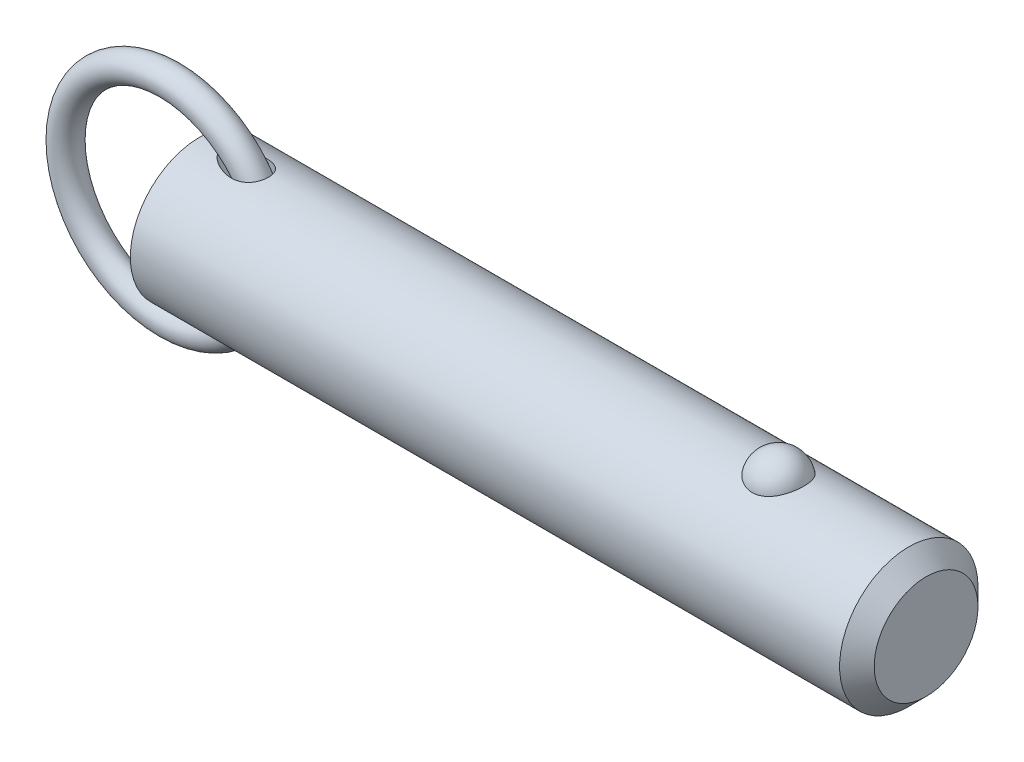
ISO-10303-21;
HEADER;
FILE_DESCRIPTION(('STEP AP214'),'2;1');
FILE_NAME('part.step','',(''),(''),'','','');
FILE_SCHEMA(('AUTOMOTIVE_DESIGN { 1 0 10303 214 1 1 1 1 }'));
ENDSEC;
DATA;
#1=APPLICATION_CONTEXT('core data for automotive mechanical design processes');
#2=APPLICATION_PROTOCOL_DEFINITION('international standard','automotive_design',2000,#1);
#3=PRODUCT_CONTEXT('',#1,'mechanical');
#4=PRODUCT('Part','Part','',(#3));
#5=PRODUCT_RELATED_PRODUCT_CATEGORY('part','',(#4));
#6=PRODUCT_DEFINITION_FORMATION('','',#4);
#7=PRODUCT_DEFINITION_CONTEXT('part definition',#1,'design');
#8=PRODUCT_DEFINITION('design','',#6,#7);
#9=PRODUCT_DEFINITION_SHAPE('','',#8);
#10=(LENGTH_UNIT() NAMED_UNIT(*) SI_UNIT(.MILLI.,.METRE.));
#11=(NAMED_UNIT(*) PLANE_ANGLE_UNIT() SI_UNIT($,.RADIAN.));
#12=(NAMED_UNIT(*) SI_UNIT($,.STERADIAN.) SOLID_ANGLE_UNIT());
#13=UNCERTAINTY_MEASURE_WITH_UNIT(LENGTH_MEASURE(1.E-05),#10,'distance_accuracy_value','');
#14=(GEOMETRIC_REPRESENTATION_CONTEXT(3) GLOBAL_UNCERTAINTY_ASSIGNED_CONTEXT((#13)) GLOBAL_UNIT_ASSIGNED_CONTEXT((#10,
#11,#12)) REPRESENTATION_CONTEXT('',''));
#15=CARTESIAN_POINT('',(0.,0.,0.));
#16=DIRECTION('',(0.,0.,1.));
#17=DIRECTION('',(1.,0.,0.));
#18=AXIS2_PLACEMENT_3D('',#15,#16,#17);
#19=CARTESIAN_POINT('',(-5.53898640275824,0.,0.));
#20=DIRECTION('',(0.,0.,1.));
#21=DIRECTION('',(1.,0.,0.));
#22=AXIS2_PLACEMENT_3D('',#19,#20,#21);
#23=TOROIDAL_SURFACE('',#22,19.05,2.54);
#24=CARTESIAN_POINT('',(16.0510135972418,0.,0.));
#25=VERTEX_POINT('',#24);
#26=VERTEX_LOOP('',#25);
#27=FACE_BOUND('',#26,.T.);
#28=ADVANCED_FACE('P0_F12',(#27),#23,.T.);
#29=CLOSED_SHELL('',(#28));
#30=MANIFOLD_SOLID_BREP('P0_B1',#29);
#31=CARTESIAN_POINT('',(0.,0.,0.));
#32=DIRECTION('',(1.,0.,0.));
#33=DIRECTION('',(0.,0.,-1.));
#34=AXIS2_PLACEMENT_3D('',#31,#32,#33);
#35=CYLINDRICAL_SURFACE('',#34,12.7);
#36=CARTESIAN_POINT('',(130.175,0.,0.));
#37=DIRECTION('',(1.,0.,0.));
#38=DIRECTION('',(0.,0.,-1.));
#39=AXIS2_PLACEMENT_3D('',#36,#37,#38);
#40=CIRCLE('',#39,12.7);
#41=CARTESIAN_POINT('',(130.175,0.,-12.7));
#42=VERTEX_POINT('',#41);
#43=EDGE_CURVE('P1_E89',#42,#42,#40,.T.);
#44=ORIENTED_EDGE('',*,*,#43,.F.);
#45=EDGE_LOOP('',(#44));
#46=FACE_BOUND('',#45,.T.);
#47=CARTESIAN_POINT('',(0.,0.,0.));
#48=DIRECTION('',(1.,0.,0.));
#49=DIRECTION('',(0.,0.,-1.));
#50=AXIS2_PLACEMENT_3D('',#47,#48,#49);
#51=CIRCLE('',#50,12.7);
#52=CARTESIAN_POINT('',(0.,0.,-12.7));
#53=VERTEX_POINT('',#52);
#54=EDGE_CURVE('P1_E52',#53,#53,#51,.T.);
#55=ORIENTED_EDGE('',*,*,#54,.T.);
#56=EDGE_LOOP('',(#55));
#57=FACE_BOUND('',#56,.T.);
#58=CARTESIAN_POINT('',(106.260042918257,11.7500437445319,4.81938502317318));
#59=CARTESIAN_POINT('',(106.135088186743,11.7500430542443,4.81938571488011));
#60=CARTESIAN_POINT('',(106.010144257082,11.7520975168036,4.81438658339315));
#61=CARTESIAN_POINT('',(105.761142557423,11.760253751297,4.79442904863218));
#62=CARTESIAN_POINT('',(105.637085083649,11.7663568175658,4.77946746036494));
#63=CARTESIAN_POINT('',(105.390901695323,11.7824262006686,4.7397141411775));
#64=CARTESIAN_POINT('',(105.268774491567,11.7923898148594,4.71492928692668));
#65=CARTESIAN_POINT('',(105.027187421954,11.8158938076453,4.65571340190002));
#66=CARTESIAN_POINT('',(104.90772859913,11.8294355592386,4.6212786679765));
#67=CARTESIAN_POINT('',(104.672557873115,11.8596812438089,4.54309502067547));
#68=CARTESIAN_POINT('',(104.556839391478,11.8763792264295,4.49936361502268));
#69=CARTESIAN_POINT('',(104.329653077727,11.9124878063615,4.40287235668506));
#70=CARTESIAN_POINT('',(104.218186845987,11.9318994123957,4.35010914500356));
#71=CARTESIAN_POINT('',(103.891278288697,11.9934256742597,4.17881316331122));
#72=CARTESIAN_POINT('',(103.683127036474,12.038858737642,4.04720756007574));
#73=CARTESIAN_POINT('',(103.285850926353,12.1352173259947,3.748564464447));
#74=CARTESIAN_POINT('',(103.097443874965,12.1862630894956,3.58061821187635));
#75=CARTESIAN_POINT('',(102.750521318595,12.2875163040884,3.21600758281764));
#76=CARTESIAN_POINT('',(102.592011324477,12.3377235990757,3.0193379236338));
#77=CARTESIAN_POINT('',(102.30168878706,12.434492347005,2.592916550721));
#78=CARTESIAN_POINT('',(102.171376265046,12.4807925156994,2.36208286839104));
#79=CARTESIAN_POINT('',(101.949407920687,12.5623454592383,1.88070399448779));
#80=CARTESIAN_POINT('',(101.857755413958,12.5975972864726,1.63015711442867));
#81=CARTESIAN_POINT('',(101.714046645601,12.6538414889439,1.1129886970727));
#82=CARTESIAN_POINT('',(101.662499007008,12.6746503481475,0.846205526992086));
#83=CARTESIAN_POINT('',(101.601977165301,12.699153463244,0.307085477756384));
#84=CARTESIAN_POINT('',(101.593001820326,12.7028481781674,0.0347487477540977));
#85=CARTESIAN_POINT('',(101.617731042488,12.6927785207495,-0.506073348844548));
#86=CARTESIAN_POINT('',(101.651189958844,12.6791146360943,-0.77457186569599));
#87=CARTESIAN_POINT('',(101.759687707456,12.635882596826,-1.30170246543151));
#88=CARTESIAN_POINT('',(101.83472729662,12.606314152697,-1.5603343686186));
#89=CARTESIAN_POINT('',(102.02500006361,12.5342328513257,-2.06083899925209));
#90=CARTESIAN_POINT('',(102.140287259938,12.4917026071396,-2.3026886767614));
#91=CARTESIAN_POINT('',(102.408704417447,12.3981123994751,-2.76259600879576));
#92=CARTESIAN_POINT('',(102.561837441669,12.3470517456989,-2.98065173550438));
#93=CARTESIAN_POINT('',(102.903507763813,12.2416045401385,-3.38786328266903));
#94=CARTESIAN_POINT('',(103.092201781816,12.1872040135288,-3.57688418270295));
#95=CARTESIAN_POINT('',(103.500239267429,12.0814086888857,-3.91941073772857));
#96=CARTESIAN_POINT('',(103.719580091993,12.0300136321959,-4.07291945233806));
#97=CARTESIAN_POINT('',(104.178375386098,11.9373542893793,-4.33691289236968));
#98=CARTESIAN_POINT('',(104.417304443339,11.8958982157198,-4.44824125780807));
#99=CARTESIAN_POINT('',(104.91243761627,11.8268116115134,-4.62881985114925));
#100=CARTESIAN_POINT('',(105.168635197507,11.7991758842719,-4.69808589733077));
#101=CARTESIAN_POINT('',(105.677164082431,11.7622209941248,-4.78983181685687));
#102=CARTESIAN_POINT('',(105.929041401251,11.7520502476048,-4.81449025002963));
#103=CARTESIAN_POINT('',(106.433573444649,11.7485796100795,-4.82295735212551));
#104=CARTESIAN_POINT('',(106.686228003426,11.7552763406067,-4.80677420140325));
#105=CARTESIAN_POINT('',(107.176834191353,11.7842584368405,-4.73525430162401));
#106=CARTESIAN_POINT('',(107.414998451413,11.8060486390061,-4.68116061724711));
#107=CARTESIAN_POINT('',(107.878489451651,11.8622750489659,-4.53678133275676));
#108=CARTESIAN_POINT('',(108.103815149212,11.8967122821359,-4.44649279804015));
#109=CARTESIAN_POINT('',(108.540801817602,11.9754603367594,-4.2298761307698));
#110=CARTESIAN_POINT('',(108.752057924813,12.0199699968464,-4.10280539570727));
#111=CARTESIAN_POINT('',(109.150601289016,12.1138028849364,-3.81685409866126));
#112=CARTESIAN_POINT('',(109.337883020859,12.163127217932,-3.65796622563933));
#113=CARTESIAN_POINT('',(109.693350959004,12.2642343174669,-3.30364864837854));
#114=CARTESIAN_POINT('',(109.860111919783,12.3160165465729,-3.10678783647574));
#115=CARTESIAN_POINT('',(110.159579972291,12.4142566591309,-2.68748409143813));
#116=CARTESIAN_POINT('',(110.292280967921,12.4607135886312,-2.46503658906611));
#117=CARTESIAN_POINT('',(110.524691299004,12.5450236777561,-1.9928951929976));
#118=CARTESIAN_POINT('',(110.623215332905,12.5825557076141,-1.7425591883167));
#119=CARTESIAN_POINT('',(110.779227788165,12.6431720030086,-1.22773734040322));
#120=CARTESIAN_POINT('',(110.836715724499,12.6662560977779,-0.963251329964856));
#121=CARTESIAN_POINT('',(110.909544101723,12.6956486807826,-0.427355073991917));
#122=CARTESIAN_POINT('',(110.924837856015,12.7019385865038,-0.155937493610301));
#123=CARTESIAN_POINT('',(110.912779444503,12.6970201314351,0.385928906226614));
#124=CARTESIAN_POINT('',(110.88542805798,12.6858120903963,0.656377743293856));
#125=CARTESIAN_POINT('',(110.813060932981,12.6568455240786,1.05454017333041));
#126=CARTESIAN_POINT('',(110.783796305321,12.6451962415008,1.18577850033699));
#127=CARTESIAN_POINT('',(110.715022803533,12.6181819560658,1.4451380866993));
#128=CARTESIAN_POINT('',(110.675517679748,12.6028183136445,1.57326046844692));
#129=CARTESIAN_POINT('',(110.586439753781,12.5687547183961,1.82554978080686));
#130=CARTESIAN_POINT('',(110.536862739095,12.5500533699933,1.9497150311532));
#131=CARTESIAN_POINT('',(110.42792115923,12.5098093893,2.1931437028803));
#132=CARTESIAN_POINT('',(110.368560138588,12.4882677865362,2.31240887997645));
#133=CARTESIAN_POINT('',(110.23997128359,12.4427679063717,2.54593031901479));
#134=CARTESIAN_POINT('',(110.170688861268,12.4187964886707,2.66015396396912));
#135=CARTESIAN_POINT('',(110.022903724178,12.3691892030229,2.88202659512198));
#136=CARTESIAN_POINT('',(109.944404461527,12.3435539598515,2.98967802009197));
#137=CARTESIAN_POINT('',(109.778550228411,12.2912955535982,3.19774385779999));
#138=CARTESIAN_POINT('',(109.691191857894,12.2646720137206,3.29815546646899));
#139=CARTESIAN_POINT('',(109.508161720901,12.2111945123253,3.49095035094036));
#140=CARTESIAN_POINT('',(109.412493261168,12.1843406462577,3.58333679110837));
#141=CARTESIAN_POINT('',(109.213627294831,12.1312249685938,3.75922876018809));
#142=CARTESIAN_POINT('',(109.110450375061,12.104961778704,3.84275713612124));
#143=CARTESIAN_POINT('',(108.89701336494,12.0537284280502,4.00056406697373));
#144=CARTESIAN_POINT('',(108.786756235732,12.028757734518,4.07484645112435));
#145=CARTESIAN_POINT('',(108.559755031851,11.9808306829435,4.21367959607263));
#146=CARTESIAN_POINT('',(108.443006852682,11.9578756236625,4.27822410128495));
#147=CARTESIAN_POINT('',(108.20394258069,11.9147184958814,4.39698483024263));
#148=CARTESIAN_POINT('',(108.081628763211,11.894515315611,4.45120522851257));
#149=CARTESIAN_POINT('',(107.822952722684,11.8561129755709,4.55255353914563));
#150=CARTESIAN_POINT('',(107.686223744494,11.8381764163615,4.59884858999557));
#151=CARTESIAN_POINT('',(107.408608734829,11.8069093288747,4.67853897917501));
#152=CARTESIAN_POINT('',(107.267724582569,11.7935767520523,4.71194005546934));
#153=CARTESIAN_POINT('',(106.98309446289,11.7720277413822,4.76552188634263));
#154=CARTESIAN_POINT('',(106.839348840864,11.7638106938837,4.78570422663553));
#155=CARTESIAN_POINT('',(106.550411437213,11.7528195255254,4.81263433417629));
#156=CARTESIAN_POINT('',(106.405219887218,11.7500445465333,4.81938421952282));
#157=CARTESIAN_POINT('',(106.260042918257,11.7500437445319,4.81938502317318));
#158=B_SPLINE_CURVE_WITH_KNOTS('',3,(#58,#59,#60,#61,#62,#63,#64,#65,#66,#67,#68,#69,#70,#71,
#72,#73,#74,#75,#76,#77,#78,#79,#80,#81,#82,#83,#84,#85,#86,#87,#88,#89,#90,#91,#92,#93,#94,#95,
#96,#97,#98,#99,#100,#101,#102,#103,#104,#105,#106,#107,#108,#109,#110,#111,#112,#113,#114,#115,
#116,#117,#118,#119,#120,#121,#122,#123,#124,#125,#126,#127,#128,#129,#130,#131,#132,#133,#134,
#135,#136,#137,#138,#139,#140,#141,#142,#143,#144,#145,#146,#147,#148,#149,#150,#151,#152,#153,
#154,#155,#156,#157),.UNSPECIFIED.,.T.,.F.,(4,2,2,2,2,2,2,2,2,2,2,2,2,2,2,2,2,2,2,2,2,2,2,2,2,2,
2,2,2,2,2,2,2,2,2,2,2,2,2,2,2,2,2,2,2,2,2,2,2,4),(0.,0.374729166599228,0.749578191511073,
1.12416526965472,1.49889629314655,1.87292776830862,2.24709865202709,2.99481328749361,
3.76399449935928,4.53331735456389,5.3368391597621,6.14042986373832,6.95405296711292,
7.76765424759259,8.57656703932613,9.38549455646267,10.1955119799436,11.0055949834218,
11.8193353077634,12.6330054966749,13.4294141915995,14.2255231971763,14.9815786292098,
15.7374826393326,16.4696948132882,17.2019663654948,17.9501979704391,18.6986017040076,
19.484470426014,20.2704797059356,21.0815215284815,21.8925729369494,22.7045213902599,
23.5164550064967,23.9209608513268,24.3253187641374,24.7298461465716,25.1342272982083,
25.54092555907,25.9474719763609,26.3541750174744,26.7607169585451,27.1661834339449,
27.5714814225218,27.9770386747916,28.3824315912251,28.8181206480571,29.2536155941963,
29.6890582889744,30.1244323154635),.UNSPECIFIED.);
#159=CARTESIAN_POINT('',(106.260042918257,11.7500437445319,4.81938502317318));
#160=VERTEX_POINT('',#159);
#161=EDGE_CURVE('P1_E80',#160,#160,#158,.T.);
#162=ORIENTED_EDGE('',*,*,#161,.T.);
#163=EDGE_LOOP('',(#162));
#164=FACE_BOUND('',#163,.T.);
#165=CARTESIAN_POINT('',(-5.53898640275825,0.,0.));
#166=DIRECTION('',(0.796400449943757,-0.604769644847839,0.));
#167=DIRECTION('',(0.604769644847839,0.796400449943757,0.));
#168=AXIS2_PLACEMENT_3D('',#165,#166,#167);
#169=ELLIPSE('',#168,15.9467514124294,12.7);
#170=CARTESIAN_POINT('',(4.09482149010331,12.6864319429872,0.586893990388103));
#171=VERTEX_POINT('',#170);
#172=CARTESIAN_POINT('',(4.09482149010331,12.6864319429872,-0.586893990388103));
#173=VERTEX_POINT('',#172);
#174=EDGE_CURVE('P1_E47',#171,#173,#169,.F.);
#175=ORIENTED_EDGE('',*,*,#174,.T.);
#176=CARTESIAN_POINT('',(4.06153170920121,12.6905758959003,-0.48916605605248));
#177=CARTESIAN_POINT('',(4.08111374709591,12.6881366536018,-0.552489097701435));
#178=CARTESIAN_POINT('',(4.10417851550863,12.6852663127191,-0.614604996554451));
#179=CARTESIAN_POINT('',(4.15628434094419,12.6787965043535,-0.736067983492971));
#180=CARTESIAN_POINT('',(4.18531032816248,12.6751988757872,-0.795421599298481));
#181=CARTESIAN_POINT('',(4.27911159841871,12.6636052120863,-0.967590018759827));
#182=CARTESIAN_POINT('',(4.35123408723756,12.654730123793,-1.07635920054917));
#183=CARTESIAN_POINT('',(4.49106800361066,12.6376715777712,-1.25922957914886));
#184=CARTESIAN_POINT('',(4.5560106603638,12.6297947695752,-1.33556751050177));
#185=CARTESIAN_POINT('',(4.69223626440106,12.6134116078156,-1.48232741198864));
#186=CARTESIAN_POINT('',(4.7635214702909,12.6049050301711,-1.55274725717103));
#187=CARTESIAN_POINT('',(4.91163946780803,12.587417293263,-1.68868704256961));
#188=CARTESIAN_POINT('',(4.98851399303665,12.5784327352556,-1.75416062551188));
#189=CARTESIAN_POINT('',(5.14630057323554,12.560235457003,-1.88003275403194));
#190=CARTESIAN_POINT('',(5.22721398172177,12.5510226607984,-1.94042957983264));
#191=CARTESIAN_POINT('',(5.45368877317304,12.5256514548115,-2.09966332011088));
#192=CARTESIAN_POINT('',(5.60261616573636,12.5094182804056,-2.19371988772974));
#193=CARTESIAN_POINT('',(5.90795545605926,12.4774211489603,-2.36893890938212));
#194=CARTESIAN_POINT('',(6.06437232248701,12.4616575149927,-2.45009264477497));
#195=CARTESIAN_POINT('',(6.38306132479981,12.431227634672,-2.60008249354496));
#196=CARTESIAN_POINT('',(6.54533237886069,12.4165611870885,-2.66892086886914));
#197=CARTESIAN_POINT('',(6.87462618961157,12.3889351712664,-2.79435199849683));
#198=CARTESIAN_POINT('',(7.0416477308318,12.3759751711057,-2.85094785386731));
#199=CARTESIAN_POINT('',(7.38726647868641,12.3518460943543,-2.95377962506));
#200=CARTESIAN_POINT('',(7.56604577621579,12.3407843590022,-2.9994320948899));
#201=CARTESIAN_POINT('',(7.92698692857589,12.3219309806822,-3.07596683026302));
#202=CARTESIAN_POINT('',(8.10914972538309,12.314140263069,-3.1068449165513));
#203=CARTESIAN_POINT('',(8.47511457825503,12.3025918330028,-3.15226850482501));
#204=CARTESIAN_POINT('',(8.6589097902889,12.2988216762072,-3.16686440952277));
#205=CARTESIAN_POINT('',(9.02696087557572,12.2959421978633,-3.17802250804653));
#206=CARTESIAN_POINT('',(9.21121628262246,12.2968292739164,-3.17459864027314));
#207=CARTESIAN_POINT('',(9.61636263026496,12.3045198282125,-3.14471110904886));
#208=CARTESIAN_POINT('',(9.83695552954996,12.3125080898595,-3.1136323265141));
#209=CARTESIAN_POINT('',(10.1619126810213,12.3303028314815,-3.04206574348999));
#210=CARTESIAN_POINT('',(10.2692747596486,12.3372061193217,-3.01403983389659));
#211=CARTESIAN_POINT('',(10.4811758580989,12.3528538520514,-2.94925947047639));
#212=CARTESIAN_POINT('',(10.5857162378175,12.361597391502,-2.91250930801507));
#213=CARTESIAN_POINT('',(10.7921321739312,12.3808585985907,-2.82951748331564));
#214=CARTESIAN_POINT('',(10.8939665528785,12.3913944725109,-2.78317723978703));
#215=CARTESIAN_POINT('',(11.0926118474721,12.4138762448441,-2.68112002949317));
#216=CARTESIAN_POINT('',(11.1894254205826,12.4258213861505,-2.62540809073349));
#217=CARTESIAN_POINT('',(11.3768740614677,12.4507225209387,-2.50465655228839));
#218=CARTESIAN_POINT('',(11.46751150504,12.4636781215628,-2.43962056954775));
#219=CARTESIAN_POINT('',(11.6414572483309,12.4901070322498,-2.30048560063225));
#220=CARTESIAN_POINT('',(11.7247669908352,12.5035802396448,-2.2263884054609));
#221=CARTESIAN_POINT('',(11.8713131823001,12.5285000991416,-2.08117367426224));
#222=CARTESIAN_POINT('',(11.9357009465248,12.5399538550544,-2.0112159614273));
#223=CARTESIAN_POINT('',(12.0576805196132,12.5624496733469,-1.86555293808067));
#224=CARTESIAN_POINT('',(12.1152732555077,12.5734917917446,-1.7898484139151));
#225=CARTESIAN_POINT('',(12.2230738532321,12.5947858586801,-1.63327883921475));
#226=CARTESIAN_POINT('',(12.2732844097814,12.6050380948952,-1.55241568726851));
#227=CARTESIAN_POINT('',(12.3658430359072,12.6243983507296,-1.38621267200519));
#228=CARTESIAN_POINT('',(12.4081916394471,12.6335064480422,-1.30087311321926));
#229=CARTESIAN_POINT('',(12.5150098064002,12.6569076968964,-1.05702619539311));
#230=CARTESIAN_POINT('',(12.5703399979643,12.6695746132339,-0.894232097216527));
#231=CARTESIAN_POINT('',(12.6526225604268,12.6886816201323,-0.561391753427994));
#232=CARTESIAN_POINT('',(12.6795825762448,12.6951233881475,-0.391347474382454));
#233=CARTESIAN_POINT('',(12.7041016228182,12.7009766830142,-0.0537636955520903));
#234=CARTESIAN_POINT('',(12.7024538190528,12.7005778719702,0.113714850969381));
#235=CARTESIAN_POINT('',(12.6717240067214,12.6932548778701,0.445979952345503));
#236=CARTESIAN_POINT('',(12.6426435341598,12.6863310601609,0.610766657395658));
#237=CARTESIAN_POINT('',(12.5579769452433,12.6667465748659,0.93242957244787));
#238=CARTESIAN_POINT('',(12.5024793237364,12.6541050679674,1.08933027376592));
#239=CARTESIAN_POINT('',(12.3665691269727,12.6244558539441,1.39146752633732));
#240=CARTESIAN_POINT('',(12.2861577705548,12.6074483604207,1.53670464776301));
#241=CARTESIAN_POINT('',(12.1018203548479,12.5706804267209,1.81319588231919));
#242=CARTESIAN_POINT('',(11.9976588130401,12.5508932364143,1.94428915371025));
#243=CARTESIAN_POINT('',(11.7695265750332,12.5107540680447,2.18776051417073));
#244=CARTESIAN_POINT('',(11.6455540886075,12.4904020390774,2.30013691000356));
#245=CARTESIAN_POINT('',(11.3759347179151,12.4502278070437,2.50870972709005));
#246=CARTESIAN_POINT('',(11.2295880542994,12.4304654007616,2.60400962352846));
#247=CARTESIAN_POINT('',(10.9239803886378,12.3941696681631,2.7716292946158));
#248=CARTESIAN_POINT('',(10.7647152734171,12.3776373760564,2.84394171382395));
#249=CARTESIAN_POINT('',(10.4192039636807,12.3473062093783,2.9730352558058));
#250=CARTESIAN_POINT('',(10.231933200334,12.3340204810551,3.02717164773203));
#251=CARTESIAN_POINT('',(9.85152982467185,12.3134301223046,3.10986173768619));
#252=CARTESIAN_POINT('',(9.65839336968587,12.3061295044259,3.13839827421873));
#253=CARTESIAN_POINT('',(9.31022514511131,12.2982822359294,3.16897517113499));
#254=CARTESIAN_POINT('',(9.15555718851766,12.2966525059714,3.1752689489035));
#255=CARTESIAN_POINT('',(8.84618945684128,12.2967963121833,3.17471335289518));
#256=CARTESIAN_POINT('',(8.69148970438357,12.2985715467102,3.16785742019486));
#257=CARTESIAN_POINT('',(8.38280471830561,12.3051648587,3.14214692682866));
#258=CARTESIAN_POINT('',(8.22882218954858,12.3099904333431,3.12326280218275));
#259=CARTESIAN_POINT('',(7.92276070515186,12.3222644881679,3.07448013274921));
#260=CARTESIAN_POINT('',(7.77068148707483,12.3297126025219,3.04458312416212));
#261=CARTESIAN_POINT('',(7.46452663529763,12.3470493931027,2.97350781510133));
#262=CARTESIAN_POINT('',(7.31052714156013,12.3570043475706,2.93201910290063));
#263=CARTESIAN_POINT('',(7.00579083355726,12.3787609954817,2.83876185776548));
#264=CARTESIAN_POINT('',(6.85505451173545,12.3905629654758,2.78699178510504));
#265=CARTESIAN_POINT('',(6.55781208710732,12.415528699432,2.6735774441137));
#266=CARTESIAN_POINT('',(6.41129783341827,12.4286895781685,2.61195394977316));
#267=CARTESIAN_POINT('',(6.12302950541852,12.4559398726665,2.47874512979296));
#268=CARTESIAN_POINT('',(5.981273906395,12.4700289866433,2.40716303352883));
#269=CARTESIAN_POINT('',(5.6707312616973,12.5020754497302,2.2355042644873));
#270=CARTESIAN_POINT('',(5.50343839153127,12.5201625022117,2.13268685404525));
#271=CARTESIAN_POINT('',(5.26147616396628,12.5471537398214,1.96522579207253));
#272=CARTESIAN_POINT('',(5.18224299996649,12.5561365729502,1.90713440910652));
#273=CARTESIAN_POINT('',(5.02746475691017,12.573912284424,1.78618989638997));
#274=CARTESIAN_POINT('',(4.9519191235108,12.5827051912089,1.72333748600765));
#275=CARTESIAN_POINT('',(4.81787163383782,12.598469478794,1.60360864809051));
#276=CARTESIAN_POINT('',(4.75865966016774,12.6054958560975,1.54753994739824));
#277=CARTESIAN_POINT('',(4.64406285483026,12.6191906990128,1.43158546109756));
#278=CARTESIAN_POINT('',(4.58867926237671,12.6258590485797,1.37169845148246));
#279=CARTESIAN_POINT('',(4.43014912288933,12.6450546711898,1.18656670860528));
#280=CARTESIAN_POINT('',(4.3337272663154,12.6568788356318,1.05507993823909));
#281=CARTESIAN_POINT('',(4.21252055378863,12.6718304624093,0.848052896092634));
#282=CARTESIAN_POINT('',(4.17660155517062,12.6762773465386,0.779100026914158));
#283=CARTESIAN_POINT('',(4.11264979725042,12.6842122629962,0.637080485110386));
#284=CARTESIAN_POINT('',(4.08466792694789,12.6876941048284,0.563990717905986));
#285=CARTESIAN_POINT('',(4.06153170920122,12.6905758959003,0.489166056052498));
#286=B_SPLINE_CURVE_WITH_KNOTS('',3,(#176,#177,#178,#179,#180,#181,#182,#183,#184,#185,#186,
#187,#188,#189,#190,#191,#192,#193,#194,#195,#196,#197,#198,#199,#200,#201,#202,#203,#204,#205,
#206,#207,#208,#209,#210,#211,#212,#213,#214,#215,#216,#217,#218,#219,#220,#221,#222,#223,#224,
#225,#226,#227,#228,#229,#230,#231,#232,#233,#234,#235,#236,#237,#238,#239,#240,#241,#242,#243,
#244,#245,#246,#247,#248,#249,#250,#251,#252,#253,#254,#255,#256,#257,#258,#259,#260,#261,#262,
#263,#264,#265,#266,#267,#268,#269,#270,#271,#272,#273,#274,#275,#276,#277,#278,#279,#280,#281,
#282,#283,#284,#285),.UNSPECIFIED.,.F.,.F.,(4,2,2,2,2,2,2,2,2,2,2,2,2,2,2,2,2,2,2,2,2,2,2,2,2,2,
2,2,2,2,2,2,2,2,2,2,2,2,2,2,2,2,2,2,2,2,2,2,2,2,2,2,2,2,4),(0.,0.198708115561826,
0.39691995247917,0.787580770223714,1.08882492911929,1.39017679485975,1.69407136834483,
1.99806847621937,2.52793143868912,3.05815092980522,3.58827293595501,4.11826050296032,
4.67218806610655,5.22627222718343,5.77863637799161,6.3305733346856,6.99657211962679,
7.32977411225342,7.66281254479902,7.99946156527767,8.33593054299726,8.67226935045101,
9.00854178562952,9.29544181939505,9.58230266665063,9.86905853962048,10.1557949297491,
10.6702338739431,11.1845341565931,11.6845985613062,12.1846349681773,12.6830079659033,
13.1813565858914,13.68487951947,14.1884479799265,14.713533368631,15.2387866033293,
15.8228373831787,16.407279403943,16.8710810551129,17.3351141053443,17.8002921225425,
18.2654052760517,18.7444169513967,19.2235004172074,19.7015868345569,20.1795185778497,
20.7699825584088,21.0658110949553,21.3615950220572,21.606957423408,21.8523988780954,
22.3397467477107,22.5729183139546,22.8075527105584),.UNSPECIFIED.);
#287=EDGE_CURVE('P1_E51',#173,#171,#286,.T.);
#288=ORIENTED_EDGE('',*,*,#287,.T.);
#289=EDGE_LOOP('',(#175,#288));
#290=FACE_BOUND('',#289,.T.);
#291=CARTESIAN_POINT('',(-5.53898640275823,0.,0.));
#292=DIRECTION('',(-0.796400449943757,-0.604769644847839,0.));
#293=DIRECTION('',(0.604769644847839,-0.796400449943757,0.));
#294=AXIS2_PLACEMENT_3D('',#291,#292,#293);
#295=ELLIPSE('',#294,15.9467514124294,12.7);
#296=CARTESIAN_POINT('',(4.09482149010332,-12.6864319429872,0.586893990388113));
#297=VERTEX_POINT('',#296);
#298=CARTESIAN_POINT('',(4.09482149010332,-12.6864319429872,-0.586893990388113));
#299=VERTEX_POINT('',#298);
#300=EDGE_CURVE('P1_E28',#297,#299,#295,.F.);
#301=ORIENTED_EDGE('',*,*,#300,.F.);
#302=CARTESIAN_POINT('',(4.06153170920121,-12.6905758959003,0.489166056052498));
#303=CARTESIAN_POINT('',(4.08111374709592,-12.6881366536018,0.552489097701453));
#304=CARTESIAN_POINT('',(4.10417851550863,-12.6852663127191,0.614604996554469));
#305=CARTESIAN_POINT('',(4.1562843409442,-12.6787965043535,0.736067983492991));
#306=CARTESIAN_POINT('',(4.18531032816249,-12.6751988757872,0.795421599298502));
#307=CARTESIAN_POINT('',(4.27911159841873,-12.6636052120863,0.96759001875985));
#308=CARTESIAN_POINT('',(4.35123408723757,-12.654730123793,1.07635920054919));
#309=CARTESIAN_POINT('',(4.49106800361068,-12.6376715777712,1.25922957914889));
#310=CARTESIAN_POINT('',(4.55601066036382,-12.6297947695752,1.3355675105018));
#311=CARTESIAN_POINT('',(4.69223626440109,-12.6134116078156,1.48232741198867));
#312=CARTESIAN_POINT('',(4.76352147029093,-12.6049050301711,1.55274725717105));
#313=CARTESIAN_POINT('',(4.91163946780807,-12.587417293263,1.68868704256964));
#314=CARTESIAN_POINT('',(4.98851399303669,-12.5784327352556,1.7541606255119));
#315=CARTESIAN_POINT('',(5.14630057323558,-12.560235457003,1.88003275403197));
#316=CARTESIAN_POINT('',(5.22721398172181,-12.5510226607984,1.94042957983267));
#317=CARTESIAN_POINT('',(5.45368877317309,-12.5256514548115,2.09966332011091));
#318=CARTESIAN_POINT('',(5.60261616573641,-12.5094182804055,2.19371988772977));
#319=CARTESIAN_POINT('',(5.90795545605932,-12.4774211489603,2.36893890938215));
#320=CARTESIAN_POINT('',(6.06437232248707,-12.4616575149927,2.450092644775));
#321=CARTESIAN_POINT('',(6.38306132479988,-12.431227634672,2.60008249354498));
#322=CARTESIAN_POINT('',(6.54533237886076,-12.4165611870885,2.66892086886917));
#323=CARTESIAN_POINT('',(6.87462618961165,-12.3889351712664,2.79435199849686));
#324=CARTESIAN_POINT('',(7.04164773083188,-12.3759751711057,2.85094785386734));
#325=CARTESIAN_POINT('',(7.38726647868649,-12.3518460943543,2.95377962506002));
#326=CARTESIAN_POINT('',(7.56604577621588,-12.3407843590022,2.99943209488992));
#327=CARTESIAN_POINT('',(7.92698692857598,-12.3219309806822,3.07596683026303));
#328=CARTESIAN_POINT('',(8.10914972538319,-12.314140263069,3.10684491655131));
#329=CARTESIAN_POINT('',(8.47511457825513,-12.3025918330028,3.15226850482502));
#330=CARTESIAN_POINT('',(8.658909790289,-12.2988216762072,3.16686440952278));
#331=CARTESIAN_POINT('',(9.02696087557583,-12.2959421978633,3.17802250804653));
#332=CARTESIAN_POINT('',(9.21121628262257,-12.2968292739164,3.17459864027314));
#333=CARTESIAN_POINT('',(9.61636263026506,-12.3045198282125,3.14471110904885));
#334=CARTESIAN_POINT('',(9.83695552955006,-12.3125080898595,3.11363232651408));
#335=CARTESIAN_POINT('',(10.1619126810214,-12.3303028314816,3.04206574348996));
#336=CARTESIAN_POINT('',(10.2692747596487,-12.3372061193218,3.01403983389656));
#337=CARTESIAN_POINT('',(10.481175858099,-12.3528538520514,2.94925947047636));
#338=CARTESIAN_POINT('',(10.5857162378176,-12.361597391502,2.91250930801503));
#339=CARTESIAN_POINT('',(10.7921321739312,-12.3808585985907,2.8295174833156));
#340=CARTESIAN_POINT('',(10.8939665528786,-12.3913944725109,2.78317723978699));
#341=CARTESIAN_POINT('',(11.0926118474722,-12.4138762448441,2.68112002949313));
#342=CARTESIAN_POINT('',(11.1894254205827,-12.4258213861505,2.62540809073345));
#343=CARTESIAN_POINT('',(11.3768740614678,-12.4507225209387,2.50465655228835));
#344=CARTESIAN_POINT('',(11.4675115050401,-12.4636781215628,2.4396205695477));
#345=CARTESIAN_POINT('',(11.641457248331,-12.4901070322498,2.3004856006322));
#346=CARTESIAN_POINT('',(11.7247669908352,-12.5035802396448,2.22638840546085));
#347=CARTESIAN_POINT('',(11.8713131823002,-12.5285000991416,2.08117367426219));
#348=CARTESIAN_POINT('',(11.9357009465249,-12.5399538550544,2.01121596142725));
#349=CARTESIAN_POINT('',(12.0576805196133,-12.5624496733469,1.86555293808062));
#350=CARTESIAN_POINT('',(12.1152732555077,-12.5734917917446,1.78984841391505));
#351=CARTESIAN_POINT('',(12.2230738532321,-12.5947858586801,1.6332788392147));
#352=CARTESIAN_POINT('',(12.2732844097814,-12.6050380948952,1.55241568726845));
#353=CARTESIAN_POINT('',(12.3658430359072,-12.6243983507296,1.38621267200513));
#354=CARTESIAN_POINT('',(12.4081916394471,-12.6335064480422,1.30087311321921));
#355=CARTESIAN_POINT('',(12.5150098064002,-12.6569076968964,1.05702619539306));
#356=CARTESIAN_POINT('',(12.5703399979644,-12.6695746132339,0.894232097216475));
#357=CARTESIAN_POINT('',(12.6526225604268,-12.6886816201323,0.561391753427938));
#358=CARTESIAN_POINT('',(12.6795825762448,-12.6951233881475,0.391347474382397));
#359=CARTESIAN_POINT('',(12.7041016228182,-12.7009766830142,0.0537636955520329));
#360=CARTESIAN_POINT('',(12.7024538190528,-12.7005778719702,-0.113714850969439));
#361=CARTESIAN_POINT('',(12.6717240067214,-12.6932548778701,-0.445979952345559));
#362=CARTESIAN_POINT('',(12.6426435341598,-12.6863310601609,-0.610766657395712));
#363=CARTESIAN_POINT('',(12.5579769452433,-12.6667465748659,-0.93242957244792));
#364=CARTESIAN_POINT('',(12.5024793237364,-12.6541050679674,-1.08933027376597));
#365=CARTESIAN_POINT('',(12.3665691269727,-12.6244558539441,-1.39146752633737));
#366=CARTESIAN_POINT('',(12.2861577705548,-12.6074483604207,-1.53670464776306));
#367=CARTESIAN_POINT('',(12.1018203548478,-12.5706804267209,-1.81319588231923));
#368=CARTESIAN_POINT('',(11.99765881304,-12.5508932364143,-1.94428915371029));
#369=CARTESIAN_POINT('',(11.7695265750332,-12.5107540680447,-2.18776051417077));
#370=CARTESIAN_POINT('',(11.6455540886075,-12.4904020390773,-2.3001369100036));
#371=CARTESIAN_POINT('',(11.375934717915,-12.4502278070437,-2.50870972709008));
#372=CARTESIAN_POINT('',(11.2295880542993,-12.4304654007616,-2.60400962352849));
#373=CARTESIAN_POINT('',(10.9239803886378,-12.3941696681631,-2.77162929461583));
#374=CARTESIAN_POINT('',(10.764715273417,-12.3776373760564,-2.84394171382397));
#375=CARTESIAN_POINT('',(10.4192039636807,-12.3473062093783,-2.97303525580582));
#376=CARTESIAN_POINT('',(10.2319332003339,-12.3340204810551,-3.02717164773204));
#377=CARTESIAN_POINT('',(9.85152982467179,-12.3134301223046,-3.1098617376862));
#378=CARTESIAN_POINT('',(9.65839336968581,-12.3061295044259,-3.13839827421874));
#379=CARTESIAN_POINT('',(9.31022514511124,-12.2982822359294,-3.168975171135));
#380=CARTESIAN_POINT('',(9.15555718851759,-12.2966525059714,-3.1752689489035));
#381=CARTESIAN_POINT('',(8.8461894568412,-12.2967963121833,-3.17471335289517));
#382=CARTESIAN_POINT('',(8.69148970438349,-12.2985715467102,-3.16785742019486));
#383=CARTESIAN_POINT('',(8.38280471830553,-12.3051648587,-3.14214692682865));
#384=CARTESIAN_POINT('',(8.2288221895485,-12.3099904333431,-3.12326280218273));
#385=CARTESIAN_POINT('',(7.92276070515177,-12.3222644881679,-3.07448013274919));
#386=CARTESIAN_POINT('',(7.77068148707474,-12.329712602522,-3.0445831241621));
#387=CARTESIAN_POINT('',(7.46452663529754,-12.3470493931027,-2.9735078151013));
#388=CARTESIAN_POINT('',(7.31052714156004,-12.3570043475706,-2.9320191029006));
#389=CARTESIAN_POINT('',(7.00579083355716,-12.3787609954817,-2.83876185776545));
#390=CARTESIAN_POINT('',(6.85505451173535,-12.3905629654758,-2.78699178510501));
#391=CARTESIAN_POINT('',(6.55781208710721,-12.415528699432,-2.67357744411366));
#392=CARTESIAN_POINT('',(6.41129783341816,-12.4286895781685,-2.61195394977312));
#393=CARTESIAN_POINT('',(6.12302950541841,-12.4559398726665,-2.47874512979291));
#394=CARTESIAN_POINT('',(5.98127390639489,-12.4700289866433,-2.40716303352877));
#395=CARTESIAN_POINT('',(5.67073126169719,-12.5020754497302,-2.23550426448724));
#396=CARTESIAN_POINT('',(5.50343839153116,-12.5201625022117,-2.13268685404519));
#397=CARTESIAN_POINT('',(5.26147616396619,-12.5471537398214,-1.96522579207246));
#398=CARTESIAN_POINT('',(5.1822429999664,-12.5561365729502,-1.90713440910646));
#399=CARTESIAN_POINT('',(5.02746475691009,-12.573912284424,-1.7861898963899));
#400=CARTESIAN_POINT('',(4.95191912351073,-12.5827051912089,-1.72333748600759));
#401=CARTESIAN_POINT('',(4.81787163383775,-12.598469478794,-1.60360864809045));
#402=CARTESIAN_POINT('',(4.75865966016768,-12.6054958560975,-1.54753994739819));
#403=CARTESIAN_POINT('',(4.6440628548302,-12.6191906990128,-1.4315854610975));
#404=CARTESIAN_POINT('',(4.58867926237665,-12.6258590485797,-1.3716984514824));
#405=CARTESIAN_POINT('',(4.43014912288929,-12.6450546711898,-1.18656670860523));
#406=CARTESIAN_POINT('',(4.33372726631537,-12.6568788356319,-1.05507993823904));
#407=CARTESIAN_POINT('',(4.2125205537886,-12.6718304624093,-0.848052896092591));
#408=CARTESIAN_POINT('',(4.17660155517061,-12.6762773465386,-0.779100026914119));
#409=CARTESIAN_POINT('',(4.11264979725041,-12.6842122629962,-0.637080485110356));
#410=CARTESIAN_POINT('',(4.08466792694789,-12.6876941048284,-0.563990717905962));
#411=CARTESIAN_POINT('',(4.06153170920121,-12.6905758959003,-0.489166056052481));
#412=B_SPLINE_CURVE_WITH_KNOTS('',3,(#302,#303,#304,#305,#306,#307,#308,#309,#310,#311,#312,
#313,#314,#315,#316,#317,#318,#319,#320,#321,#322,#323,#324,#325,#326,#327,#328,#329,#330,#331,
#332,#333,#334,#335,#336,#337,#338,#339,#340,#341,#342,#343,#344,#345,#346,#347,#348,#349,#350,
#351,#352,#353,#354,#355,#356,#357,#358,#359,#360,#361,#362,#363,#364,#365,#366,#367,#368,#369,
#370,#371,#372,#373,#374,#375,#376,#377,#378,#379,#380,#381,#382,#383,#384,#385,#386,#387,#388,
#389,#390,#391,#392,#393,#394,#395,#396,#397,#398,#399,#400,#401,#402,#403,#404,#405,#406,#407,
#408,#409,#410,#411),.UNSPECIFIED.,.F.,.F.,(4,2,2,2,2,2,2,2,2,2,2,2,2,2,2,2,2,2,2,2,2,2,2,2,2,2,
2,2,2,2,2,2,2,2,2,2,2,2,2,2,2,2,2,2,2,2,2,2,2,2,2,2,2,2,4),(0.,0.198708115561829,
0.396919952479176,0.787580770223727,1.08882492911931,1.39017679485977,1.69407136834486,
1.9980684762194,2.52793143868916,3.05815092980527,3.58827293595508,4.11826050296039,
4.67218806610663,5.22627222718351,5.77863637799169,6.3305733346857,6.99657211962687,
7.3297741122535,7.6628125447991,7.99946156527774,8.33593054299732,8.67226935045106,
9.00854178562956,9.29544181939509,9.58230266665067,9.86905853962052,10.1557949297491,
10.6702338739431,11.1845341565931,11.6845985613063,12.1846349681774,12.6830079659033,
13.1813565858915,13.68487951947,14.1884479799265,14.7135333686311,15.2387866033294,
15.8228373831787,16.4072794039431,16.871081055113,17.3351141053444,17.8002921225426,
18.2654052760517,18.7444169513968,19.2235004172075,19.701586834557,20.1795185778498,
20.7699825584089,21.0658110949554,21.3615950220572,21.6069574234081,21.8523988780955,
22.3397467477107,22.5729183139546,22.8075527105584),.UNSPECIFIED.);
#413=EDGE_CURVE('P1_E10',#297,#299,#412,.T.);
#414=ORIENTED_EDGE('',*,*,#413,.T.);
#415=EDGE_LOOP('',(#301,#414));
#416=FACE_BOUND('',#415,.T.);
#417=ADVANCED_FACE('P1_F15',(#46,#57,#164,#290,#416),#35,.T.);
#418=CARTESIAN_POINT('',(0.,0.,0.));
#419=DIRECTION('',(-1.,0.,0.));
#420=DIRECTION('',(0.,0.,1.));
#421=AXIS2_PLACEMENT_3D('',#418,#419,#420);
#422=PLANE('',#421);
#423=ORIENTED_EDGE('',*,*,#54,.F.);
#424=EDGE_LOOP('',(#423));
#425=FACE_BOUND('',#424,.T.);
#426=ADVANCED_FACE('P1_F17',(#425),#422,.T.);
#427=CARTESIAN_POINT('',(133.35,0.,0.));
#428=DIRECTION('',(-1.,0.,0.));
#429=DIRECTION('',(0.,0.,1.));
#430=AXIS2_PLACEMENT_3D('',#427,#428,#429);
#431=CONICAL_SURFACE('',#430,9.52500000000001,0.785398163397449);
#432=ORIENTED_EDGE('',*,*,#43,.T.);
#433=EDGE_LOOP('',(#432));
#434=FACE_BOUND('',#433,.T.);
#435=CARTESIAN_POINT('',(133.35,0.,0.));
#436=DIRECTION('',(1.,0.,0.));
#437=DIRECTION('',(0.,0.,-1.));
#438=AXIS2_PLACEMENT_3D('',#435,#436,#437);
#439=CIRCLE('',#438,9.52500000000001);
#440=CARTESIAN_POINT('',(133.35,0.,-9.52500000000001));
#441=VERTEX_POINT('',#440);
#442=EDGE_CURVE('P1_E86',#441,#441,#439,.T.);
#443=ORIENTED_EDGE('',*,*,#442,.F.);
#444=EDGE_LOOP('',(#443));
#445=FACE_BOUND('',#444,.T.);
#446=ADVANCED_FACE('P1_F105',(#434,#445),#431,.T.);
#447=CARTESIAN_POINT('',(133.35,9.52500000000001,0.));
#448=DIRECTION('',(1.,0.,0.));
#449=DIRECTION('',(0.,0.,-1.));
#450=AXIS2_PLACEMENT_3D('',#447,#448,#449);
#451=PLANE('',#450);
#452=ORIENTED_EDGE('',*,*,#442,.T.);
#453=EDGE_LOOP('',(#452));
#454=FACE_BOUND('',#453,.T.);
#455=ADVANCED_FACE('P1_F78',(#454),#451,.T.);
#456=CARTESIAN_POINT('',(106.260042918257,11.43,0.));
#457=DIRECTION('',(-1.,0.,0.));
#458=DIRECTION('',(0.,-1.,0.));
#459=AXIS2_PLACEMENT_3D('',#456,#457,#458);
#460=SPHERICAL_SURFACE('',#459,4.83);
#461=ORIENTED_EDGE('',*,*,#161,.F.);
#462=EDGE_LOOP('',(#461));
#463=FACE_BOUND('',#462,.T.);
#464=ADVANCED_FACE('P1_F71',(#463),#460,.T.);
#465=CARTESIAN_POINT('',(-5.53898640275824,0.,0.));
#466=DIRECTION('',(0.,0.,1.));
#467=DIRECTION('',(1.,0.,0.));
#468=AXIS2_PLACEMENT_3D('',#465,#466,#467);
#469=TOROIDAL_SURFACE('',#468,19.05,3.175);
#470=CARTESIAN_POINT('',(5.9818753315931,-15.1714285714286,0.));
#471=DIRECTION('',(-0.796400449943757,-0.604769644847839,0.));
#472=DIRECTION('',(0.604769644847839,-0.796400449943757,0.));
#473=AXIS2_PLACEMENT_3D('',#470,#471,#472);
#474=CIRCLE('',#473,3.175);
#475=EDGE_CURVE('P1_E34',#297,#299,#474,.T.);
#476=ORIENTED_EDGE('',*,*,#475,.T.);
#477=ORIENTED_EDGE('',*,*,#413,.F.);
#478=EDGE_LOOP('',(#476,#477));
#479=FACE_BOUND('',#478,.T.);
#480=CARTESIAN_POINT('',(5.9818753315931,15.1714285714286,0.));
#481=DIRECTION('',(0.796400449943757,-0.604769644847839,0.));
#482=DIRECTION('',(0.604769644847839,0.796400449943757,0.));
#483=AXIS2_PLACEMENT_3D('',#480,#481,#482);
#484=CIRCLE('',#483,3.175);
#485=EDGE_CURVE('P1_E41',#171,#173,#484,.T.);
#486=ORIENTED_EDGE('',*,*,#485,.F.);
#487=ORIENTED_EDGE('',*,*,#287,.F.);
#488=EDGE_LOOP('',(#486,#487));
#489=FACE_BOUND('',#488,.T.);
#490=ADVANCED_FACE('P1_F55',(#479,#489),#469,.F.);
#491=CARTESIAN_POINT('',(5.9818753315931,-15.1714285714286,0.));
#492=DIRECTION('',(-0.796400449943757,-0.604769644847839,0.));
#493=DIRECTION('',(0.604769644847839,-0.796400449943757,0.));
#494=AXIS2_PLACEMENT_3D('',#491,#492,#493);
#495=PLANE('',#494);
#496=ORIENTED_EDGE('',*,*,#300,.T.);
#497=ORIENTED_EDGE('',*,*,#475,.F.);
#498=EDGE_LOOP('',(#496,#497));
#499=FACE_BOUND('',#498,.T.);
#500=ADVANCED_FACE('P1_F70',(#499),#495,.F.);
#501=CARTESIAN_POINT('',(5.9818753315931,15.1714285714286,0.));
#502=DIRECTION('',(0.796400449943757,-0.604769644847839,0.));
#503=DIRECTION('',(0.604769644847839,0.796400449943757,0.));
#504=AXIS2_PLACEMENT_3D('',#501,#502,#503);
#505=PLANE('',#504);
#506=ORIENTED_EDGE('',*,*,#485,.T.);
#507=ORIENTED_EDGE('',*,*,#174,.F.);
#508=EDGE_LOOP('',(#506,#507));
#509=FACE_BOUND('',#508,.T.);
#510=ADVANCED_FACE('P1_F48',(#509),#505,.T.);
#511=CLOSED_SHELL('',(#417,#426,#446,#455,#464,#490,#500,#510));
#512=MANIFOLD_SOLID_BREP('P1_B1',#511);
#513=ADVANCED_BREP_SHAPE_REPRESENTATION('',(#18,#30,#512),#14);
#514=SHAPE_DEFINITION_REPRESENTATION(#9,#513);
ENDSEC;
END-ISO-10303-21;
